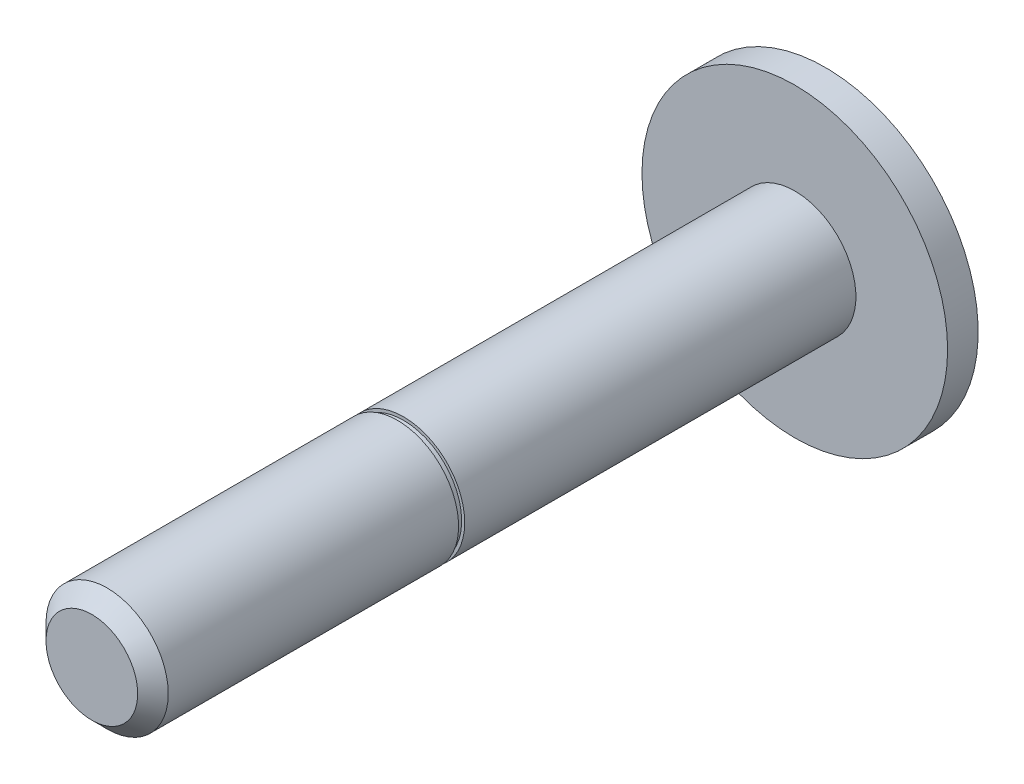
ISO-10303-21;
HEADER;
FILE_DESCRIPTION(('STEP AP214'),'2;1');
FILE_NAME('part.step','',(''),(''),'','','');
FILE_SCHEMA(('AUTOMOTIVE_DESIGN { 1 0 10303 214 1 1 1 1 }'));
ENDSEC;
DATA;
#1=APPLICATION_CONTEXT('core data for automotive mechanical design processes');
#2=APPLICATION_PROTOCOL_DEFINITION('international standard','automotive_design',2000,#1);
#3=PRODUCT_CONTEXT('',#1,'mechanical');
#4=PRODUCT('Part','Part','',(#3));
#5=PRODUCT_RELATED_PRODUCT_CATEGORY('part','',(#4));
#6=PRODUCT_DEFINITION_FORMATION('','',#4);
#7=PRODUCT_DEFINITION_CONTEXT('part definition',#1,'design');
#8=PRODUCT_DEFINITION('design','',#6,#7);
#9=PRODUCT_DEFINITION_SHAPE('','',#8);
#10=(LENGTH_UNIT() NAMED_UNIT(*) SI_UNIT(.MILLI.,.METRE.));
#11=(NAMED_UNIT(*) PLANE_ANGLE_UNIT() SI_UNIT($,.RADIAN.));
#12=(NAMED_UNIT(*) SI_UNIT($,.STERADIAN.) SOLID_ANGLE_UNIT());
#13=UNCERTAINTY_MEASURE_WITH_UNIT(LENGTH_MEASURE(1.E-05),#10,'distance_accuracy_value','');
#14=(GEOMETRIC_REPRESENTATION_CONTEXT(3) GLOBAL_UNCERTAINTY_ASSIGNED_CONTEXT((#13)) GLOBAL_UNIT_ASSIGNED_CONTEXT((#10,
#11,#12)) REPRESENTATION_CONTEXT('',''));
#15=CARTESIAN_POINT('',(0.,0.,0.));
#16=DIRECTION('',(0.,0.,1.));
#17=DIRECTION('',(1.,0.,0.));
#18=AXIS2_PLACEMENT_3D('',#15,#16,#17);
#19=CARTESIAN_POINT('',(0.,0.,32.5));
#20=DIRECTION('',(0.,0.,1.));
#21=DIRECTION('',(1.,0.,0.));
#22=AXIS2_PLACEMENT_3D('',#19,#20,#21);
#23=PLANE('',#22);
#24=CARTESIAN_POINT('',(0.,0.,32.5));
#25=DIRECTION('',(0.,0.,1.));
#26=DIRECTION('',(1.,0.,0.));
#27=AXIS2_PLACEMENT_3D('',#24,#25,#26);
#28=CIRCLE('',#27,1.5);
#29=CARTESIAN_POINT('',(-1.5,0.,32.5));
#30=VERTEX_POINT('',#29);
#31=EDGE_CURVE('E83',#30,#30,#28,.T.);
#32=ORIENTED_EDGE('',*,*,#31,.T.);
#33=EDGE_LOOP('',(#32));
#34=FACE_BOUND('',#33,.T.);
#35=ADVANCED_FACE('F17',(#34),#23,.T.);
#36=CARTESIAN_POINT('',(0.,2.,22.3));
#37=DIRECTION('',(0.,0.,-1.));
#38=DIRECTION('',(0.,-1.,0.));
#39=AXIS2_PLACEMENT_3D('',#36,#37,#38);
#40=PLANE('',#39);
#41=CARTESIAN_POINT('',(0.,0.,22.3));
#42=DIRECTION('',(0.,0.,-1.));
#43=DIRECTION('',(-1.,0.,0.));
#44=AXIS2_PLACEMENT_3D('',#41,#42,#43);
#45=CIRCLE('',#44,1.9);
#46=CARTESIAN_POINT('',(-1.9,0.,22.3));
#47=VERTEX_POINT('',#46);
#48=EDGE_CURVE('E21',#47,#47,#45,.T.);
#49=ORIENTED_EDGE('',*,*,#48,.T.);
#50=EDGE_LOOP('',(#49));
#51=FACE_BOUND('',#50,.T.);
#52=CARTESIAN_POINT('',(0.,0.,22.3));
#53=DIRECTION('',(0.,0.,-1.));
#54=DIRECTION('',(-1.,0.,0.));
#55=AXIS2_PLACEMENT_3D('',#52,#53,#54);
#56=CIRCLE('',#55,2.);
#57=CARTESIAN_POINT('',(2.,0.,22.3));
#58=VERTEX_POINT('',#57);
#59=EDGE_CURVE('E28',#58,#58,#56,.T.);
#60=ORIENTED_EDGE('',*,*,#59,.F.);
#61=EDGE_LOOP('',(#60));
#62=FACE_BOUND('',#61,.T.);
#63=ADVANCED_FACE('F175',(#51,#62),#40,.F.);
#64=CARTESIAN_POINT('',(0.,2.,22.5));
#65=DIRECTION('',(0.,0.,1.));
#66=DIRECTION('',(1.,0.,0.));
#67=AXIS2_PLACEMENT_3D('',#64,#65,#66);
#68=PLANE('',#67);
#69=CARTESIAN_POINT('',(0.,0.,22.5));
#70=DIRECTION('',(0.,0.,-1.));
#71=DIRECTION('',(-1.,0.,0.));
#72=AXIS2_PLACEMENT_3D('',#69,#70,#71);
#73=CIRCLE('',#72,1.9);
#74=CARTESIAN_POINT('',(1.9,0.,22.5));
#75=VERTEX_POINT('',#74);
#76=EDGE_CURVE('E86',#75,#75,#73,.T.);
#77=ORIENTED_EDGE('',*,*,#76,.F.);
#78=EDGE_LOOP('',(#77));
#79=FACE_BOUND('',#78,.T.);
#80=CARTESIAN_POINT('',(0.,0.,22.5));
#81=DIRECTION('',(0.,0.,-1.));
#82=DIRECTION('',(-1.,0.,0.));
#83=AXIS2_PLACEMENT_3D('',#80,#81,#82);
#84=CIRCLE('',#83,2.);
#85=CARTESIAN_POINT('',(-2.,0.,22.5));
#86=VERTEX_POINT('',#85);
#87=EDGE_CURVE('E87',#86,#86,#84,.T.);
#88=ORIENTED_EDGE('',*,*,#87,.T.);
#89=EDGE_LOOP('',(#88));
#90=FACE_BOUND('',#89,.T.);
#91=ADVANCED_FACE('F163',(#79,#90),#68,.F.);
#92=CARTESIAN_POINT('',(0.,0.,8.5));
#93=DIRECTION('',(0.,0.,1.));
#94=DIRECTION('',(1.,0.,0.));
#95=AXIS2_PLACEMENT_3D('',#92,#93,#94);
#96=PLANE('',#95);
#97=CARTESIAN_POINT('',(0.,0.,8.5));
#98=DIRECTION('',(0.,0.,-1.));
#99=DIRECTION('',(-1.,0.,0.));
#100=AXIS2_PLACEMENT_3D('',#97,#98,#99);
#101=CIRCLE('',#100,5.);
#102=CARTESIAN_POINT('',(-5.,0.,8.5));
#103=VERTEX_POINT('',#102);
#104=EDGE_CURVE('E59',#103,#103,#101,.T.);
#105=ORIENTED_EDGE('',*,*,#104,.T.);
#106=EDGE_LOOP('',(#105));
#107=FACE_BOUND('',#106,.T.);
#108=ADVANCED_FACE('F152',(#107),#96,.F.);
#109=CARTESIAN_POINT('',(0.,0.,9.5));
#110=DIRECTION('',(0.,0.,-1.));
#111=DIRECTION('',(0.,-1.,0.));
#112=AXIS2_PLACEMENT_3D('',#109,#110,#111);
#113=PLANE('',#112);
#114=CARTESIAN_POINT('',(0.,0.,9.5));
#115=DIRECTION('',(0.,0.,-1.));
#116=DIRECTION('',(-1.,0.,0.));
#117=AXIS2_PLACEMENT_3D('',#114,#115,#116);
#118=CIRCLE('',#117,2.);
#119=CARTESIAN_POINT('',(-2.,0.,9.5));
#120=VERTEX_POINT('',#119);
#121=EDGE_CURVE('E11',#120,#120,#118,.T.);
#122=ORIENTED_EDGE('',*,*,#121,.T.);
#123=EDGE_LOOP('',(#122));
#124=FACE_BOUND('',#123,.T.);
#125=CARTESIAN_POINT('',(0.,0.,9.5));
#126=DIRECTION('',(0.,0.,-1.));
#127=DIRECTION('',(-1.,0.,0.));
#128=AXIS2_PLACEMENT_3D('',#125,#126,#127);
#129=CIRCLE('',#128,5.);
#130=CARTESIAN_POINT('',(5.,0.,9.5));
#131=VERTEX_POINT('',#130);
#132=EDGE_CURVE('E66',#131,#131,#129,.T.);
#133=ORIENTED_EDGE('',*,*,#132,.F.);
#134=EDGE_LOOP('',(#133));
#135=FACE_BOUND('',#134,.T.);
#136=ADVANCED_FACE('F147',(#124,#135),#113,.F.);
#137=CARTESIAN_POINT('',(0.,0.,32.5));
#138=DIRECTION('',(0.,0.,-1.));
#139=DIRECTION('',(-1.,0.,0.));
#140=AXIS2_PLACEMENT_3D('',#137,#138,#139);
#141=CYLINDRICAL_SURFACE('',#140,2.);
#142=ORIENTED_EDGE('',*,*,#121,.F.);
#143=EDGE_LOOP('',(#142));
#144=FACE_BOUND('',#143,.T.);
#145=ORIENTED_EDGE('',*,*,#59,.T.);
#146=EDGE_LOOP('',(#145));
#147=FACE_BOUND('',#146,.T.);
#148=ADVANCED_FACE('F19',(#144,#147),#141,.T.);
#149=CARTESIAN_POINT('',(0.,0.,9.5));
#150=DIRECTION('',(0.,0.,-1.));
#151=DIRECTION('',(-1.,0.,0.));
#152=AXIS2_PLACEMENT_3D('',#149,#150,#151);
#153=CYLINDRICAL_SURFACE('',#152,5.);
#154=ORIENTED_EDGE('',*,*,#104,.F.);
#155=EDGE_LOOP('',(#154));
#156=FACE_BOUND('',#155,.T.);
#157=ORIENTED_EDGE('',*,*,#132,.T.);
#158=EDGE_LOOP('',(#157));
#159=FACE_BOUND('',#158,.T.);
#160=ADVANCED_FACE('F134',(#156,#159),#153,.T.);
#161=CARTESIAN_POINT('',(0.,0.,8.5));
#162=DIRECTION('',(0.,0.,-1.));
#163=DIRECTION('',(-1.,0.,0.));
#164=AXIS2_PLACEMENT_3D('',#161,#162,#163);
#165=CYLINDRICAL_SURFACE('',#164,1.9);
#166=ORIENTED_EDGE('',*,*,#48,.F.);
#167=EDGE_LOOP('',(#166));
#168=FACE_BOUND('',#167,.T.);
#169=ORIENTED_EDGE('',*,*,#76,.T.);
#170=EDGE_LOOP('',(#169));
#171=FACE_BOUND('',#170,.T.);
#172=ADVANCED_FACE('F123',(#168,#171),#165,.T.);
#173=CARTESIAN_POINT('',(0.,0.,32.5));
#174=DIRECTION('',(0.,0.,-1.));
#175=DIRECTION('',(-1.,0.,0.));
#176=AXIS2_PLACEMENT_3D('',#173,#174,#175);
#177=CONICAL_SURFACE('',#176,1.5,0.785398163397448);
#178=CARTESIAN_POINT('',(0.,0.,32.));
#179=DIRECTION('',(0.,0.,-1.));
#180=DIRECTION('',(1.,0.,0.));
#181=AXIS2_PLACEMENT_3D('',#178,#179,#180);
#182=CIRCLE('',#181,2.);
#183=CARTESIAN_POINT('',(2.,0.,32.));
#184=VERTEX_POINT('',#183);
#185=EDGE_CURVE('E95',#184,#184,#182,.T.);
#186=ORIENTED_EDGE('',*,*,#185,.F.);
#187=EDGE_LOOP('',(#186));
#188=FACE_BOUND('',#187,.T.);
#189=ORIENTED_EDGE('',*,*,#31,.F.);
#190=EDGE_LOOP('',(#189));
#191=FACE_BOUND('',#190,.T.);
#192=ADVANCED_FACE('F117',(#188,#191),#177,.T.);
#193=CARTESIAN_POINT('',(0.,0.,32.5));
#194=DIRECTION('',(0.,0.,-1.));
#195=DIRECTION('',(-1.,0.,0.));
#196=AXIS2_PLACEMENT_3D('',#193,#194,#195);
#197=CYLINDRICAL_SURFACE('',#196,2.);
#198=ORIENTED_EDGE('',*,*,#87,.F.);
#199=EDGE_LOOP('',(#198));
#200=FACE_BOUND('',#199,.T.);
#201=ORIENTED_EDGE('',*,*,#185,.T.);
#202=EDGE_LOOP('',(#201));
#203=FACE_BOUND('',#202,.T.);
#204=ADVANCED_FACE('F122',(#200,#203),#197,.T.);
#205=CLOSED_SHELL('',(#35,#63,#91,#108,#136,#148,#160,#172,#192,#204));
#206=MANIFOLD_SOLID_BREP('B1',#205);
#207=ADVANCED_BREP_SHAPE_REPRESENTATION('',(#18,#206),#14);
#208=SHAPE_DEFINITION_REPRESENTATION(#9,#207);
ENDSEC;
END-ISO-10303-21;
